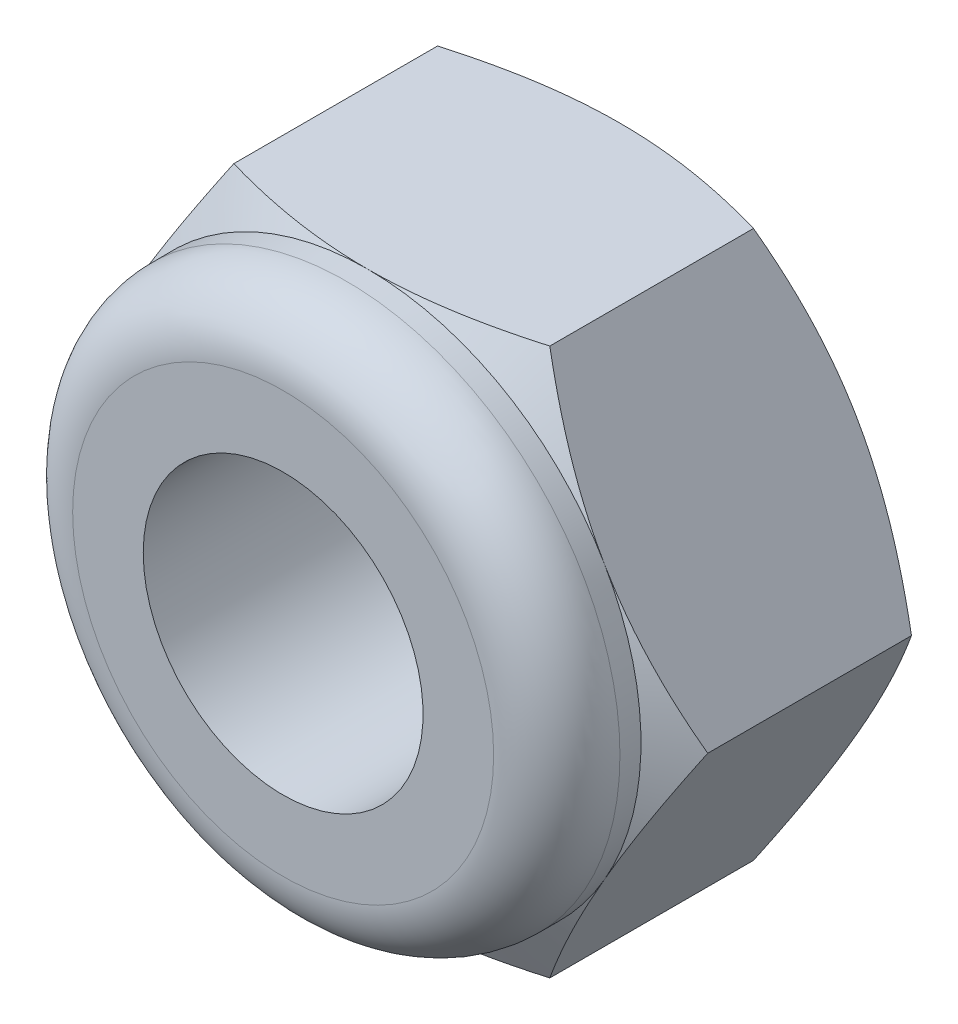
ISO-10303-21;
HEADER;
FILE_DESCRIPTION(('STEP AP214'),'2;1');
FILE_NAME('part.step','',(''),(''),'','','');
FILE_SCHEMA(('AUTOMOTIVE_DESIGN { 1 0 10303 214 1 1 1 1 }'));
ENDSEC;
DATA;
#1=APPLICATION_CONTEXT('core data for automotive mechanical design processes');
#2=APPLICATION_PROTOCOL_DEFINITION('international standard','automotive_design',2000,#1);
#3=PRODUCT_CONTEXT('',#1,'mechanical');
#4=PRODUCT('Part','Part','',(#3));
#5=PRODUCT_RELATED_PRODUCT_CATEGORY('part','',(#4));
#6=PRODUCT_DEFINITION_FORMATION('','',#4);
#7=PRODUCT_DEFINITION_CONTEXT('part definition',#1,'design');
#8=PRODUCT_DEFINITION('design','',#6,#7);
#9=PRODUCT_DEFINITION_SHAPE('','',#8);
#10=(LENGTH_UNIT() NAMED_UNIT(*) SI_UNIT(.MILLI.,.METRE.));
#11=(NAMED_UNIT(*) PLANE_ANGLE_UNIT() SI_UNIT($,.RADIAN.));
#12=(NAMED_UNIT(*) SI_UNIT($,.STERADIAN.) SOLID_ANGLE_UNIT());
#13=UNCERTAINTY_MEASURE_WITH_UNIT(LENGTH_MEASURE(1.E-05),#10,'distance_accuracy_value','');
#14=(GEOMETRIC_REPRESENTATION_CONTEXT(3) GLOBAL_UNCERTAINTY_ASSIGNED_CONTEXT((#13)) GLOBAL_UNIT_ASSIGNED_CONTEXT((#10,
#11,#12)) REPRESENTATION_CONTEXT('',''));
#15=CARTESIAN_POINT('',(0.,0.,0.));
#16=DIRECTION('',(0.,0.,1.));
#17=DIRECTION('',(1.,0.,0.));
#18=AXIS2_PLACEMENT_3D('',#15,#16,#17);
#19=CARTESIAN_POINT('',(0.,0.,-0.584039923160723));
#20=DIRECTION('',(0.,0.,-1.));
#21=DIRECTION('',(-1.,0.,0.));
#22=AXIS2_PLACEMENT_3D('',#19,#20,#21);
#23=CONICAL_SURFACE('',#22,7.51158682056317,1.0471975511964);
#24=CARTESIAN_POINT('',(0.,-6.5,3.6505613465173E-13));
#25=CARTESIAN_POINT('',(-0.159284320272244,-6.5,2.65652581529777E-05));
#26=CARTESIAN_POINT('',(-0.318560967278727,-6.5,-0.00337972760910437));
#27=CARTESIAN_POINT('',(-0.636801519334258,-6.5,-0.0168605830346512));
#28=CARTESIAN_POINT('',(-0.79576548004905,-6.5,-0.0269338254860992));
#29=CARTESIAN_POINT('',(-1.11235387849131,-6.5,-0.0534848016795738));
#30=CARTESIAN_POINT('',(-1.2699810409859,-6.5,-0.0699302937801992));
#31=CARTESIAN_POINT('',(-1.58448437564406,-6.5,-0.108872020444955));
#32=CARTESIAN_POINT('',(-1.74136052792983,-6.5,-0.131368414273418));
#33=CARTESIAN_POINT('',(-2.21021220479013,-6.5,-0.207238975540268));
#34=CARTESIAN_POINT('',(-2.52082569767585,-6.5,-0.269031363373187));
#35=CARTESIAN_POINT('',(-3.13938154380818,-6.5,-0.411540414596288));
#36=CARTESIAN_POINT('',(-3.44730232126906,-6.5,-0.492351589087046));
#37=CARTESIAN_POINT('',(-3.752776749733,-6.5,-0.580556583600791));
#38=B_SPLINE_CURVE_WITH_KNOTS('',3,(#24,#25,#26,#27,#28,#29,#30,#31,#32,#33,#34,#35,#36,#37),
.UNSPECIFIED.,.F.,.F.,(4,2,2,2,2,2,4),(0.,0.477804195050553,0.955513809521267,1.43083727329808,
1.90617324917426,2.85559935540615,3.80984701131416),.UNSPECIFIED.);
#39=CARTESIAN_POINT('',(0.,-6.5,0.));
#40=VERTEX_POINT('',#39);
#41=CARTESIAN_POINT('',(-3.752776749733,-6.5,-0.580556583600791));
#42=VERTEX_POINT('',#41);
#43=EDGE_CURVE('E125',#40,#42,#38,.T.);
#44=ORIENTED_EDGE('',*,*,#43,.F.);
#45=CARTESIAN_POINT('',(0.,0.,2.73652628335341E-13));
#46=DIRECTION('',(0.,0.,-1.));
#47=DIRECTION('',(1.,0.,0.));
#48=AXIS2_PLACEMENT_3D('',#45,#46,#47);
#49=CIRCLE('',#48,6.50000000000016);
#50=CARTESIAN_POINT('',(-5.62916512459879,-3.25000000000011,0.));
#51=VERTEX_POINT('',#50);
#52=EDGE_CURVE('E375',#40,#51,#49,.T.);
#53=ORIENTED_EDGE('',*,*,#52,.T.);
#54=CARTESIAN_POINT('',(-3.752776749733,-6.5,-0.580556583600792));
#55=CARTESIAN_POINT('',(-3.90551397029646,-6.23545137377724,-0.492351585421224));
#56=CARTESIAN_POINT('',(-4.05947436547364,-5.96878414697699,-0.411540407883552));
#57=CARTESIAN_POINT('',(-4.36875230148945,-5.4330990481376,-0.269031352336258));
#58=CARTESIAN_POINT('',(-4.52405905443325,-5.1640998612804,-0.207238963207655));
#59=CARTESIAN_POINT('',(-4.75848490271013,-4.75806238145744,-0.131368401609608));
#60=CARTESIAN_POINT('',(-4.83692298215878,-4.62220364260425,-0.108872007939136));
#61=CARTESIAN_POINT('',(-4.9941746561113,-4.34983575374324,-0.0699302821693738));
#62=CARTESIAN_POINT('',(-5.07298824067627,-4.2133266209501,-0.0534847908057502));
#63=CARTESIAN_POINT('',(-5.23128244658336,-3.93915301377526,-0.0269338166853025));
#64=CARTESIAN_POINT('',(-5.31076443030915,-3.80148617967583,-0.0168605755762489));
#65=CARTESIAN_POINT('',(-5.46988471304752,-3.52588176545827,-0.00337972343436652));
#66=CARTESIAN_POINT('',(-5.54952303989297,-3.38794413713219,2.65674914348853E-05));
#67=CARTESIAN_POINT('',(-5.62916520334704,-3.24999986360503,1.05718922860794E-13));
#68=B_SPLINE_CURVE_WITH_KNOTS('',3,(#54,#55,#56,#57,#58,#59,#60,#61,#62,#63,#64,#65,#66,#67),
.UNSPECIFIED.,.F.,.F.,(4,2,2,2,2,2,4),(0.,0.954247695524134,1.90367384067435,2.3790098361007,
2.85433331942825,3.33204295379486,3.80984716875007),.UNSPECIFIED.);
#69=EDGE_CURVE('E306',#42,#51,#68,.T.);
#70=ORIENTED_EDGE('',*,*,#69,.F.);
#71=EDGE_LOOP('',(#44,#53,#70));
#72=FACE_BOUND('',#71,.T.);
#73=ADVANCED_FACE('F41',(#72),#23,.T.);
#74=CARTESIAN_POINT('',(0.,0.,-0.584039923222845));
#75=DIRECTION('',(0.,0.,-1.));
#76=DIRECTION('',(-1.,0.,0.));
#77=AXIS2_PLACEMENT_3D('',#74,#75,#76);
#78=CONICAL_SURFACE('',#77,7.51158682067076,1.0471975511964);
#79=CARTESIAN_POINT('',(-5.62916520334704,-3.24999986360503,1.0578884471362E-13));
#80=CARTESIAN_POINT('',(-5.70880736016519,-3.11205560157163,2.65630243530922E-05));
#81=CARTESIAN_POINT('',(-5.78844568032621,-2.97411798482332,-0.00337973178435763));
#82=CARTESIAN_POINT('',(-5.94756594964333,-2.69851359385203,-0.0168605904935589));
#83=CARTESIAN_POINT('',(-6.02704792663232,-2.5608467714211,-0.0269338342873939));
#84=CARTESIAN_POINT('',(-6.18534211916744,-2.28667318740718,-0.0534848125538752));
#85=CARTESIAN_POINT('',(-6.26415569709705,-2.15016406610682,-0.0699303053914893));
#86=CARTESIAN_POINT('',(-6.42140735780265,-1.87779620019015,-0.10887203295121));
#87=CARTESIAN_POINT('',(-6.49984543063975,-1.7419374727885,-0.131368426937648));
#88=CARTESIAN_POINT('',(-6.73427125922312,-1.3359000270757,-0.207238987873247));
#89=CARTESIAN_POINT('',(-6.88957799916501,-1.06690086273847,-0.269031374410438));
#90=CARTESIAN_POINT('',(-7.19885590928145,-0.531215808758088,-0.411540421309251));
#91=CARTESIAN_POINT('',(-7.35281629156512,-0.264548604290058,-0.492351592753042));
#92=CARTESIAN_POINT('',(-7.50555349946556,-2.9712334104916E-13,-0.580556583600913));
#93=B_SPLINE_CURVE_WITH_KNOTS('',3,(#79,#80,#81,#82,#83,#84,#85,#86,#87,#88,#89,#90,#91,#92),
.UNSPECIFIED.,.F.,.F.,(4,2,2,2,2,2,4),(0.,0.477804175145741,0.95551376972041,1.43083721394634,
1.90617317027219,2.85559923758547,3.80984685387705),.UNSPECIFIED.);
#94=CARTESIAN_POINT('',(-7.50555349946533,-2.39924732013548E-13,-0.580556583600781));
#95=VERTEX_POINT('',#94);
#96=EDGE_CURVE('E124',#51,#95,#93,.T.);
#97=ORIENTED_EDGE('',*,*,#96,.F.);
#98=CARTESIAN_POINT('',(0.,0.,1.01481323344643E-13));
#99=DIRECTION('',(0.,0.,-1.));
#100=DIRECTION('',(1.,0.,0.));
#101=AXIS2_PLACEMENT_3D('',#98,#99,#100);
#102=CIRCLE('',#101,6.50000000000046);
#103=CARTESIAN_POINT('',(-5.62916512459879,3.25000000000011,0.));
#104=VERTEX_POINT('',#103);
#105=EDGE_CURVE('E380',#51,#104,#102,.T.);
#106=ORIENTED_EDGE('',*,*,#105,.T.);
#107=CARTESIAN_POINT('',(-7.50555349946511,-1.81661842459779E-13,-0.580556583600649));
#108=CARTESIAN_POINT('',(-7.35281627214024,0.264548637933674,-0.492351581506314));
#109=CARTESIAN_POINT('',(-7.19885587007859,0.531215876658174,-0.411540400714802));
#110=CARTESIAN_POINT('',(-6.88957792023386,1.06690099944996,-0.269031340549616));
#111=CARTESIAN_POINT('',(-6.7342711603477,1.33590019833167,-0.207238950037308));
#112=CARTESIAN_POINT('',(-6.49984530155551,1.7419376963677,-0.131368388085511));
#113=CARTESIAN_POINT('',(-6.42140721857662,1.87779644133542,-0.108871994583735));
#114=CARTESIAN_POINT('',(-6.26415553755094,2.15016434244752,-0.069930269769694));
#115=CARTESIAN_POINT('',(-6.18534194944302,2.28667348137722,-0.0534847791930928));
#116=CARTESIAN_POINT('',(-6.02704773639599,2.56084710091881,-0.0269338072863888));
#117=CARTESIAN_POINT('',(-5.94756574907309,2.69851394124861,-0.0168605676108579));
#118=CARTESIAN_POINT('',(-5.78844545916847,2.97411836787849,-0.00337971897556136));
#119=CARTESIAN_POINT('',(-5.70880712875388,3.1120560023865,2.65698769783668E-05));
#120=CARTESIAN_POINT('',(-5.62916496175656,3.25000028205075,4.69329275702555E-13));
#121=B_SPLINE_CURVE_WITH_KNOTS('',3,(#107,#108,#109,#110,#111,#112,#113,#114,#115,#116,#117,
#118,#119,#120),.UNSPECIFIED.,.F.,.F.,(4,2,2,2,2,2,4),(0.,0.95424773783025,1.9036739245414,
2.3790099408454,2.85433344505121,3.33204310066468,3.80984733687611),.UNSPECIFIED.);
#122=EDGE_CURVE('E291',#95,#104,#121,.T.);
#123=ORIENTED_EDGE('',*,*,#122,.F.);
#124=EDGE_LOOP('',(#97,#106,#123));
#125=FACE_BOUND('',#124,.T.);
#126=ADVANCED_FACE('F316',(#125),#78,.T.);
#127=CARTESIAN_POINT('',(0.,0.,-0.5840399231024));
#128=DIRECTION('',(0.,0.,-1.));
#129=DIRECTION('',(0.,1.,0.));
#130=AXIS2_PLACEMENT_3D('',#127,#128,#129);
#131=CONICAL_SURFACE('',#130,7.51158682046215,1.0471975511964);
#132=CARTESIAN_POINT('',(-5.62916496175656,3.25000028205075,4.69415984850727E-13));
#133=CARTESIAN_POINT('',(-5.54952280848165,3.38794453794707,2.65606395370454E-05));
#134=CARTESIAN_POINT('',(-5.46988449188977,3.52588214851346,-0.00337973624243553));
#135=CARTESIAN_POINT('',(-5.31076422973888,3.80148652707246,-0.0168605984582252));
#136=CARTESIAN_POINT('',(-5.231282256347,3.93915334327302,-0.0269338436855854));
#137=CARTESIAN_POINT('',(-5.07298807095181,4.21332691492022,-0.0534848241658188));
#138=CARTESIAN_POINT('',(-4.99417449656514,4.34983603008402,-0.0699303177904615));
#139=CARTESIAN_POINT('',(-4.8369228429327,4.62220388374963,-0.108872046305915));
#140=CARTESIAN_POINT('',(-4.75848477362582,4.75806260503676,-0.131368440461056));
#141=CARTESIAN_POINT('',(-4.52405895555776,5.16410003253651,-0.207239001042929));
#142=CARTESIAN_POINT('',(-4.36875222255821,5.43309918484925,-0.269031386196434));
#143=CARTESIAN_POINT('',(-4.05947432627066,5.96878421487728,-0.411540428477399));
#144=CARTESIAN_POINT('',(-3.90551395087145,6.23545140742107,-0.492351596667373));
#145=CARTESIAN_POINT('',(-3.75277674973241,6.49999999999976,-0.580556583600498));
#146=B_SPLINE_CURVE_WITH_KNOTS('',3,(#132,#133,#134,#135,#136,#137,#138,#139,#140,#141,#142,
#143,#144,#145),.UNSPECIFIED.,.F.,.F.,(4,2,2,2,2,2,4),(0.,0.477804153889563,0.955513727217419,
1.43083715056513,1.90617308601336,2.85559911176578,3.80984668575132),.UNSPECIFIED.);
#147=CARTESIAN_POINT('',(-3.7527767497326,6.49999999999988,-0.580556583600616));
#148=VERTEX_POINT('',#147);
#149=EDGE_CURVE('E299',#104,#148,#146,.T.);
#150=ORIENTED_EDGE('',*,*,#149,.F.);
#151=CARTESIAN_POINT('',(0.,0.,1.31838984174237E-13));
#152=DIRECTION('',(0.,0.,-1.));
#153=DIRECTION('',(1.,0.,0.));
#154=AXIS2_PLACEMENT_3D('',#151,#152,#153);
#155=CIRCLE('',#154,6.50000000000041);
#156=CARTESIAN_POINT('',(0.,6.5,0.));
#157=VERTEX_POINT('',#156);
#158=EDGE_CURVE('E382',#104,#157,#155,.T.);
#159=ORIENTED_EDGE('',*,*,#158,.T.);
#160=CARTESIAN_POINT('',(-3.7527767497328,6.5,-0.580556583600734));
#161=CARTESIAN_POINT('',(-3.44730232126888,6.5,-0.492351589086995));
#162=CARTESIAN_POINT('',(-3.13938154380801,6.5,-0.411540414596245));
#163=CARTESIAN_POINT('',(-2.52082569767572,6.5,-0.269031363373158));
#164=CARTESIAN_POINT('',(-2.21021220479,6.5,-0.207238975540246));
#165=CARTESIAN_POINT('',(-1.74136052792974,6.5,-0.131368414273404));
#166=CARTESIAN_POINT('',(-1.58448437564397,6.5,-0.108872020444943));
#167=CARTESIAN_POINT('',(-1.26998104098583,6.5,-0.069930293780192));
#168=CARTESIAN_POINT('',(-1.11235387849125,6.5,-0.0534848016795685));
#169=CARTESIAN_POINT('',(-0.795765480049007,6.5,-0.0269338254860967));
#170=CARTESIAN_POINT('',(-0.636801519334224,6.5,-0.0168605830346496));
#171=CARTESIAN_POINT('',(-0.318560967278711,6.5,-0.00337972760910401));
#172=CARTESIAN_POINT('',(-0.159284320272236,6.5,2.65652581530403E-05));
#173=CARTESIAN_POINT('',(0.,6.5,3.64962709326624E-13));
#174=B_SPLINE_CURVE_WITH_KNOTS('',3,(#160,#161,#162,#163,#164,#165,#166,#167,#168,#169,#170,
#171,#172,#173),.UNSPECIFIED.,.F.,.F.,(4,2,2,2,2,2,4),(0.,0.954247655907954,1.90367376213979,
2.37900973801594,2.85433320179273,3.33204281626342,3.80984701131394),.UNSPECIFIED.);
#175=EDGE_CURVE('E321',#148,#157,#174,.T.);
#176=ORIENTED_EDGE('',*,*,#175,.F.);
#177=EDGE_LOOP('',(#150,#159,#176));
#178=FACE_BOUND('',#177,.T.);
#179=ADVANCED_FACE('F313',(#178),#131,.T.);
#180=CARTESIAN_POINT('',(0.,0.,-0.5840399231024));
#181=DIRECTION('',(0.,0.,-1.));
#182=DIRECTION('',(0.,1.,0.));
#183=AXIS2_PLACEMENT_3D('',#180,#181,#182);
#184=CONICAL_SURFACE('',#183,7.51158682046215,1.0471975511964);
#185=CARTESIAN_POINT('',(0.,6.5,3.65048800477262E-13));
#186=CARTESIAN_POINT('',(0.159284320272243,6.5,2.6565258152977E-05));
#187=CARTESIAN_POINT('',(0.318560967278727,6.5,-0.0033797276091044));
#188=CARTESIAN_POINT('',(0.636801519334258,6.5,-0.0168605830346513));
#189=CARTESIAN_POINT('',(0.79576548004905,6.5,-0.0269338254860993));
#190=CARTESIAN_POINT('',(1.11235387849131,6.5,-0.0534848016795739));
#191=CARTESIAN_POINT('',(1.2699810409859,6.5,-0.0699302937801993));
#192=CARTESIAN_POINT('',(1.58448437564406,6.5,-0.108872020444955));
#193=CARTESIAN_POINT('',(1.74136052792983,6.5,-0.131368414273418));
#194=CARTESIAN_POINT('',(2.21021220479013,6.5,-0.207238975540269));
#195=CARTESIAN_POINT('',(2.52082569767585,6.5,-0.269031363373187));
#196=CARTESIAN_POINT('',(3.13938154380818,6.5,-0.411540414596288));
#197=CARTESIAN_POINT('',(3.44730232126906,6.5,-0.492351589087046));
#198=CARTESIAN_POINT('',(3.752776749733,6.5,-0.580556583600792));
#199=B_SPLINE_CURVE_WITH_KNOTS('',3,(#185,#186,#187,#188,#189,#190,#191,#192,#193,#194,#195,
#196,#197,#198),.UNSPECIFIED.,.F.,.F.,(4,2,2,2,2,2,4),(0.,0.477804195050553,0.955513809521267,
1.43083727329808,1.90617324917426,2.85559935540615,3.80984701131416),.UNSPECIFIED.);
#200=CARTESIAN_POINT('',(3.752776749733,6.5,-0.580556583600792));
#201=VERTEX_POINT('',#200);
#202=EDGE_CURVE('E334',#157,#201,#199,.T.);
#203=ORIENTED_EDGE('',*,*,#202,.F.);
#204=CARTESIAN_POINT('',(0.,0.,2.73652628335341E-13));
#205=DIRECTION('',(0.,0.,-1.));
#206=DIRECTION('',(1.,0.,0.));
#207=AXIS2_PLACEMENT_3D('',#204,#205,#206);
#208=CIRCLE('',#207,6.50000000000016);
#209=CARTESIAN_POINT('',(5.62916512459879,3.25000000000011,0.));
#210=VERTEX_POINT('',#209);
#211=EDGE_CURVE('E359',#157,#210,#208,.T.);
#212=ORIENTED_EDGE('',*,*,#211,.T.);
#213=CARTESIAN_POINT('',(3.752776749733,6.5,-0.580556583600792));
#214=CARTESIAN_POINT('',(3.90551396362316,6.23545138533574,-0.492351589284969));
#215=CARTESIAN_POINT('',(4.05947435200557,5.96878417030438,-0.411540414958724));
#216=CARTESIAN_POINT('',(4.36875227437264,5.4330990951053,-0.269031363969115));
#217=CARTESIAN_POINT('',(4.52405902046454,5.16409992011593,-0.207238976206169));
#218=CARTESIAN_POINT('',(4.75848485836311,4.75806245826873,-0.131368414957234));
#219=CARTESIAN_POINT('',(4.83692293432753,4.62220372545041,-0.108872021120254));
#220=CARTESIAN_POINT('',(4.99417460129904,4.34983584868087,-0.0699302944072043));
#221=CARTESIAN_POINT('',(5.07298818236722,4.21332672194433,-0.0534848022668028));
#222=CARTESIAN_POINT('',(5.23128238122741,3.93915312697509,-0.0269338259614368));
#223=CARTESIAN_POINT('',(5.31076436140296,3.80148629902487,-0.0168605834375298));
#224=CARTESIAN_POINT('',(5.46988463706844,3.52588189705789,-0.00337972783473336));
#225=CARTESIAN_POINT('',(5.54952296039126,3.38794427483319,2.65651373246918E-05));
#226=CARTESIAN_POINT('',(5.62916512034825,3.25000000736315,1.06755980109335E-13));
#227=B_SPLINE_CURVE_WITH_KNOTS('',3,(#213,#214,#215,#216,#217,#218,#219,#220,#221,#222,#223,
#224,#225,#226),.UNSPECIFIED.,.F.,.F.,(4,2,2,2,2,2,4),(0.,0.954247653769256,1.90367375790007,
2.37900973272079,2.85433319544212,3.33204280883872,3.80984700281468),.UNSPECIFIED.);
#228=EDGE_CURVE('E143',#201,#210,#227,.T.);
#229=ORIENTED_EDGE('',*,*,#228,.F.);
#230=EDGE_LOOP('',(#203,#212,#229));
#231=FACE_BOUND('',#230,.T.);
#232=ADVANCED_FACE('F176',(#231),#184,.T.);
#233=CARTESIAN_POINT('',(0.,0.,-0.5840399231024));
#234=DIRECTION('',(0.,0.,-1.));
#235=DIRECTION('',(0.,1.,0.));
#236=AXIS2_PLACEMENT_3D('',#233,#234,#235);
#237=CONICAL_SURFACE('',#236,7.51158682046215,1.0471975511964);
#238=CARTESIAN_POINT('',(5.6291651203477,-3.25000000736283,4.74270947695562E-13));
#239=CARTESIAN_POINT('',(5.5495229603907,-3.38794427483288,2.65651376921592E-05));
#240=CARTESIAN_POINT('',(5.46988463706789,-3.52588189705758,-0.00337972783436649));
#241=CARTESIAN_POINT('',(5.3107643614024,-3.80148629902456,-0.016860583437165));
#242=CARTESIAN_POINT('',(5.23128238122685,-3.93915312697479,-0.0269338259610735));
#243=CARTESIAN_POINT('',(5.07298818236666,-4.21332672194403,-0.0534848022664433));
#244=CARTESIAN_POINT('',(4.99417460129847,-4.34983584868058,-0.0699302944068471));
#245=CARTESIAN_POINT('',(4.83692293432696,-4.62220372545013,-0.108872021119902));
#246=CARTESIAN_POINT('',(4.75848485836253,-4.75806245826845,-0.131368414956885));
#247=CARTESIAN_POINT('',(4.52405902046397,-5.16409992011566,-0.20723897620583));
#248=CARTESIAN_POINT('',(4.36875227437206,-5.43309909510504,-0.269031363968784));
#249=CARTESIAN_POINT('',(4.05947435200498,-5.96878417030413,-0.411540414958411));
#250=CARTESIAN_POINT('',(3.90551396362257,-6.23545138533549,-0.492351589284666));
#251=CARTESIAN_POINT('',(3.75277674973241,-6.49999999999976,-0.580556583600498));
#252=B_SPLINE_CURVE_WITH_KNOTS('',3,(#238,#239,#240,#241,#242,#243,#244,#245,#246,#247,#248,
#249,#250,#251),.UNSPECIFIED.,.F.,.F.,(4,2,2,2,2,2,4),(0.,0.477804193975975,0.955513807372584,
1.43083727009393,1.90617324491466,2.8555993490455,3.80984700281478),.UNSPECIFIED.);
#253=CARTESIAN_POINT('',(5.62916512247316,-3.25000000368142,3.40134680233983E-13));
#254=VERTEX_POINT('',#253);
#255=CARTESIAN_POINT('',(3.75277674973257,-6.49999999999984,-0.580556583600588));
#256=VERTEX_POINT('',#255);
#257=EDGE_CURVE('E117',#254,#256,#252,.T.);
#258=ORIENTED_EDGE('',*,*,#257,.F.);
#259=CARTESIAN_POINT('',(0.,0.,2.05998412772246E-13));
#260=DIRECTION('',(0.,0.,-1.));
#261=DIRECTION('',(1.,0.,0.));
#262=AXIS2_PLACEMENT_3D('',#259,#260,#261);
#263=CIRCLE('',#262,6.50000000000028);
#264=EDGE_CURVE('E120',#254,#40,#263,.T.);
#265=ORIENTED_EDGE('',*,*,#264,.T.);
#266=CARTESIAN_POINT('',(3.7527767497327,-6.5,-0.580556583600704));
#267=CARTESIAN_POINT('',(3.44730232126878,-6.5,-0.49235158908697));
#268=CARTESIAN_POINT('',(3.13938154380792,-6.5,-0.411540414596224));
#269=CARTESIAN_POINT('',(2.52082569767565,-6.5,-0.269031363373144));
#270=CARTESIAN_POINT('',(2.21021220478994,-6.5,-0.207238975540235));
#271=CARTESIAN_POINT('',(1.74136052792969,-6.5,-0.131368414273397));
#272=CARTESIAN_POINT('',(1.58448437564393,-6.5,-0.108872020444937));
#273=CARTESIAN_POINT('',(1.26998104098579,-6.5,-0.069930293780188));
#274=CARTESIAN_POINT('',(1.11235387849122,-6.5,-0.0534848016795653));
#275=CARTESIAN_POINT('',(0.795765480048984,-6.5,-0.0269338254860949));
#276=CARTESIAN_POINT('',(0.636801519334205,-6.5,-0.0168605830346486));
#277=CARTESIAN_POINT('',(0.318560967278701,-6.5,-0.00337972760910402));
#278=CARTESIAN_POINT('',(0.159284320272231,-6.5,2.65652581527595E-05));
#279=CARTESIAN_POINT('',(0.,-6.5,3.64925290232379E-13));
#280=B_SPLINE_CURVE_WITH_KNOTS('',3,(#266,#267,#268,#269,#270,#271,#272,#273,#274,#275,#276,
#277,#278,#279),.UNSPECIFIED.,.F.,.F.,(4,2,2,2,2,2,4),(0.,0.954247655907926,1.90367376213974,
2.37900973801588,2.85433320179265,3.33204281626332,3.80984701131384),.UNSPECIFIED.);
#281=EDGE_CURVE('E113',#256,#40,#280,.T.);
#282=ORIENTED_EDGE('',*,*,#281,.F.);
#283=EDGE_LOOP('',(#258,#265,#282));
#284=FACE_BOUND('',#283,.T.);
#285=ADVANCED_FACE('F115',(#284),#237,.T.);
#286=CARTESIAN_POINT('',(0.,0.,-0.584039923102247));
#287=DIRECTION('',(0.,0.,-1.));
#288=DIRECTION('',(0.,1.,0.));
#289=AXIS2_PLACEMENT_3D('',#286,#287,#288);
#290=CONICAL_SURFACE('',#289,7.51158682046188,1.0471975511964);
#291=CARTESIAN_POINT('',(5.62916512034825,3.25000000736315,1.07249429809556E-13));
#292=CARTESIAN_POINT('',(5.70880728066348,3.11205573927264,2.65653784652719E-05));
#293=CARTESIAN_POINT('',(5.78844560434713,2.97411811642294,-0.00337972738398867));
#294=CARTESIAN_POINT('',(5.94756588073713,2.69851371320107,-0.0168605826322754));
#295=CARTESIAN_POINT('',(6.02704786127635,2.56084688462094,-0.0269338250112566));
#296=CARTESIAN_POINT('',(6.18534206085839,2.28667328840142,-0.0534848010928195));
#297=CARTESIAN_POINT('',(6.26415564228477,2.15016416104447,-0.069930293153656));
#298=CARTESIAN_POINT('',(6.42140730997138,1.87779628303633,-0.108872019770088));
#299=CARTESIAN_POINT('',(6.49984538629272,1.74193754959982,-0.131368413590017));
#300=CARTESIAN_POINT('',(6.73427122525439,1.33590008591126,-0.207238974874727));
#301=CARTESIAN_POINT('',(6.88957797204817,1.06690090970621,-0.269031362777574));
#302=CARTESIAN_POINT('',(7.19885589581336,0.531215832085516,-0.411540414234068));
#303=CARTESIAN_POINT('',(7.3528162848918,0.264548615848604,-0.492351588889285));
#304=CARTESIAN_POINT('',(7.50555349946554,3.41994650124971E-13,-0.580556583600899));
#305=B_SPLINE_CURVE_WITH_KNOTS('',3,(#291,#292,#293,#294,#295,#296,#297,#298,#299,#300,#301,
#302,#303,#304),.UNSPECIFIED.,.F.,.F.,(4,2,2,2,2,2,4),(0.,0.477804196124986,0.95551381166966,
1.4308372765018,1.90617325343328,2.85559936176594,3.80984701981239),.UNSPECIFIED.);
#306=CARTESIAN_POINT('',(7.50555349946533,2.8374856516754E-13,-0.580556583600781));
#307=VERTEX_POINT('',#306);
#308=EDGE_CURVE('E328',#210,#307,#305,.T.);
#309=ORIENTED_EDGE('',*,*,#308,.F.);
#310=CARTESIAN_POINT('',(0.,0.,2.73652628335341E-13));
#311=DIRECTION('',(0.,0.,-1.));
#312=DIRECTION('',(1.,0.,0.));
#313=AXIS2_PLACEMENT_3D('',#310,#311,#312);
#314=CIRCLE('',#313,6.50000000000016);
#315=EDGE_CURVE('E358',#210,#254,#314,.T.);
#316=ORIENTED_EDGE('',*,*,#315,.T.);
#317=CARTESIAN_POINT('',(7.50555349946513,2.25393252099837E-13,-0.580556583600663));
#318=CARTESIAN_POINT('',(7.35281628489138,-0.264548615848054,-0.492351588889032));
#319=CARTESIAN_POINT('',(7.19885589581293,-0.531215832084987,-0.411540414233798));
#320=CARTESIAN_POINT('',(6.88957797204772,-1.06690090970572,-0.269031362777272));
#321=CARTESIAN_POINT('',(6.73427122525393,-1.33590008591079,-0.20723897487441));
#322=CARTESIAN_POINT('',(6.49984538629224,-1.74193754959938,-0.131368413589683));
#323=CARTESIAN_POINT('',(6.4214073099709,-1.8777962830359,-0.108872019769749));
#324=CARTESIAN_POINT('',(6.26415564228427,-2.15016416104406,-0.0699302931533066));
#325=CARTESIAN_POINT('',(6.18534206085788,-2.28667328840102,-0.0534848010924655));
#326=CARTESIAN_POINT('',(6.02704786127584,-2.56084688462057,-0.0269338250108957));
#327=CARTESIAN_POINT('',(5.94756588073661,-2.6985137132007,-0.0168605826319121));
#328=CARTESIAN_POINT('',(5.78844560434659,-2.9741181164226,-0.00337972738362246));
#329=CARTESIAN_POINT('',(5.70880728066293,-3.11205573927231,2.65653788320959E-05));
#330=CARTESIAN_POINT('',(5.6291651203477,-3.25000000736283,4.74095637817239E-13));
#331=B_SPLINE_CURVE_WITH_KNOTS('',3,(#317,#318,#319,#320,#321,#322,#323,#324,#325,#326,#327,
#328,#329,#330),.UNSPECIFIED.,.F.,.F.,(4,2,2,2,2,2,4),(0.,0.954247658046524,1.90367376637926,
2.37900974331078,2.85433320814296,3.33204282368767,3.8098470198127),.UNSPECIFIED.);
#332=EDGE_CURVE('E141',#307,#254,#331,.T.);
#333=ORIENTED_EDGE('',*,*,#332,.F.);
#334=EDGE_LOOP('',(#309,#316,#333));
#335=FACE_BOUND('',#334,.T.);
#336=ADVANCED_FACE('F175',(#335),#290,.T.);
#337=CARTESIAN_POINT('',(3.752776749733,-6.5,0.));
#338=DIRECTION('',(0.,-1.,0.));
#339=DIRECTION('',(0.,0.,-1.));
#340=AXIS2_PLACEMENT_3D('',#337,#338,#339);
#341=PLANE('',#340);
#342=DIRECTION('',(0.,0.,1.));
#343=VECTOR('',#342,1.);
#344=CARTESIAN_POINT('',(3.75277674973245,-6.49999999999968,0.));
#345=LINE('',#344,#343);
#346=CARTESIAN_POINT('',(3.75277676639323,-6.49999999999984,-5.41944341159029));
#347=VERTEX_POINT('',#346);
#348=EDGE_CURVE('E128',#256,#347,#345,.F.);
#349=ORIENTED_EDGE('',*,*,#348,.F.);
#350=ORIENTED_EDGE('',*,*,#281,.T.);
#351=ORIENTED_EDGE('',*,*,#43,.T.);
#352=DIRECTION('',(0.,0.,1.));
#353=VECTOR('',#352,1.);
#354=CARTESIAN_POINT('',(-3.752776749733,-6.5,0.));
#355=LINE('',#354,#353);
#356=CARTESIAN_POINT('',(-3.75277674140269,-6.50000001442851,-5.41944341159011));
#357=VERTEX_POINT('',#356);
#358=EDGE_CURVE('E421',#357,#42,#355,.T.);
#359=ORIENTED_EDGE('',*,*,#358,.F.);
#360=CARTESIAN_POINT('',(0.,-6.5,-6.00000000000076));
#361=CARTESIAN_POINT('',(-0.159284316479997,-6.5,-6.00002656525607));
#362=CARTESIAN_POINT('',(-0.318560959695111,-6.5,-5.99662027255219));
#363=CARTESIAN_POINT('',(-0.636801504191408,-6.5,-5.98313941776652));
#364=CARTESIAN_POINT('',(-0.795765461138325,-6.5,-5.97306617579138));
#365=CARTESIAN_POINT('',(-1.11235385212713,-6.5,-5.94651520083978));
#366=CARTESIAN_POINT('',(-1.26998101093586,-6.5,-5.93006970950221));
#367=CARTESIAN_POINT('',(-1.58448433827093,-6.5,-5.89112798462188));
#368=CARTESIAN_POINT('',(-1.74136048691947,-6.5,-5.86863159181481));
#369=CARTESIAN_POINT('',(-2.21021215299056,-6.5,-5.79276103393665));
#370=CARTESIAN_POINT('',(-2.52082563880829,-6.5,-5.73096864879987));
#371=CARTESIAN_POINT('',(-3.13938147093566,-6.5,-5.58845960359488));
#372=CARTESIAN_POINT('',(-3.44730224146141,-6.5,-5.50764843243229));
#373=CARTESIAN_POINT('',(-3.7527766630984,-6.5,-5.41944344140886));
#374=B_SPLINE_CURVE_WITH_KNOTS('',3,(#360,#361,#362,#363,#364,#365,#366,#367,#368,#369,#370,
#371,#372,#373),.UNSPECIFIED.,.F.,.F.,(4,2,2,2,2,2,4),(0.,0.47780418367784,0.955513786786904,
1.43083723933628,1.90617320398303,2.85559928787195,3.80984692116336),.UNSPECIFIED.);
#375=CARTESIAN_POINT('',(0.,-6.50000000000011,-6.0000000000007));
#376=VERTEX_POINT('',#375);
#377=EDGE_CURVE('E209',#376,#357,#374,.T.);
#378=ORIENTED_EDGE('',*,*,#377,.F.);
#379=CARTESIAN_POINT('',(3.75277678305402,-6.5,-5.41944340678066));
#380=CARTESIAN_POINT('',(3.44730235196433,-6.5,-5.50764840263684));
#381=CARTESIAN_POINT('',(3.13938157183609,-6.5,-5.58845957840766));
#382=CARTESIAN_POINT('',(2.52082572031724,-6.5,-5.73096863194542));
#383=CARTESIAN_POINT('',(2.21021222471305,-6.5,-5.79276102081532));
#384=CARTESIAN_POINT('',(1.74136054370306,-6.5,-5.86863158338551));
#385=CARTESIAN_POINT('',(1.58448439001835,-6.5,-5.89112797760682));
#386=CARTESIAN_POINT('',(1.26998105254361,-6.5,-5.93006970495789));
#387=CARTESIAN_POINT('',(1.11235388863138,-6.5,-5.946515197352));
#388=CARTESIAN_POINT('',(0.79576548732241,-6.5,-5.97306617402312));
#389=CARTESIAN_POINT('',(0.636801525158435,-6.5,-5.98313941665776));
#390=CARTESIAN_POINT('',(0.318560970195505,-6.5,-5.99662027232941));
#391=CARTESIAN_POINT('',(0.159284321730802,-6.5,-6.00002656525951));
#392=CARTESIAN_POINT('',(0.,-6.5,-6.00000000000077));
#393=B_SPLINE_CURVE_WITH_KNOTS('',3,(#379,#380,#381,#382,#383,#384,#385,#386,#387,#388,#389,
#390,#391,#392),.UNSPECIFIED.,.F.,.F.,(4,2,2,2,2,2,4),(0.,0.954247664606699,1.90367377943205,
2.37900975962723,2.8543332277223,3.33204284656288,3.80984704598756),.UNSPECIFIED.);
#394=EDGE_CURVE('E131',#347,#376,#393,.T.);
#395=ORIENTED_EDGE('',*,*,#394,.F.);
#396=EDGE_LOOP('',(#349,#350,#351,#359,#378,#395));
#397=FACE_BOUND('',#396,.T.);
#398=ADVANCED_FACE('F129',(#397),#341,.T.);
#399=CARTESIAN_POINT('',(-3.752776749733,-6.5,0.));
#400=DIRECTION('',(-0.866025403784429,-0.500000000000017,0.));
#401=DIRECTION('',(0.500000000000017,-0.866025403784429,0.));
#402=AXIS2_PLACEMENT_3D('',#399,#400,#401);
#403=PLANE('',#402);
#404=ORIENTED_EDGE('',*,*,#358,.T.);
#405=ORIENTED_EDGE('',*,*,#69,.T.);
#406=ORIENTED_EDGE('',*,*,#96,.T.);
#407=DIRECTION('',(0.,0.,1.));
#408=VECTOR('',#407,1.);
#409=CARTESIAN_POINT('',(-7.505553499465,0.,0.));
#410=LINE('',#409,#408);
#411=CARTESIAN_POINT('',(-7.50555350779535,-1.44285809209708E-08,-5.41944341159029));
#412=VERTEX_POINT('',#411);
#413=EDGE_CURVE('E305',#412,#95,#410,.T.);
#414=ORIENTED_EDGE('',*,*,#413,.F.);
#415=CARTESIAN_POINT('',(-5.62916512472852,-3.2499999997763,-6.00000000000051));
#416=CARTESIAN_POINT('',(-5.70880728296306,-3.11205573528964,-6.00002656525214));
#417=CARTESIAN_POINT('',(-5.78844560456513,-2.97411811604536,-5.99662027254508));
#418=CARTESIAN_POINT('',(-5.94756587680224,-2.6985137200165,-5.98313941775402));
#419=CARTESIAN_POINT('',(-6.02704785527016,-2.56084689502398,-5.97306617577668));
#420=CARTESIAN_POINT('',(-6.18534205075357,-2.28667330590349,-5.94651520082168));
#421=CARTESIAN_POINT('',(-6.26415563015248,-2.15016418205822,-5.9300697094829));
#422=CARTESIAN_POINT('',(-6.42140729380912,-1.87779631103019,-5.89112798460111));
#423=CARTESIAN_POINT('',(-6.49984536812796,-1.74193758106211,-5.86863159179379));
#424=CARTESIAN_POINT('',(-6.73427120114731,-1.33590012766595,-5.79276103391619));
#425=CARTESIAN_POINT('',(-6.88957794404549,-1.06690095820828,-5.73096864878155));
#426=CARTESIAN_POINT('',(-7.19885586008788,-0.531215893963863,-5.5884596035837));
#427=CARTESIAN_POINT('',(-7.35281624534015,-0.264548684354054,-5.50764843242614));
#428=CARTESIAN_POINT('',(-7.50555345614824,-7.50281066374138E-08,-5.41944344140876));
#429=B_SPLINE_CURVE_WITH_KNOTS('',3,(#415,#416,#417,#418,#419,#420,#421,#422,#423,#424,#425,
#426,#427,#428),.UNSPECIFIED.,.F.,.F.,(4,2,2,2,2,2,4),(0.,0.477804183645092,0.955513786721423,
1.43083723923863,1.90617320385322,2.8555992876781,3.80984692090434),.UNSPECIFIED.);
#430=CARTESIAN_POINT('',(-5.62916512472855,-3.24999999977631,-6.00000000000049));
#431=VERTEX_POINT('',#430);
#432=EDGE_CURVE('E251',#431,#412,#429,.T.);
#433=ORIENTED_EDGE('',*,*,#432,.F.);
#434=CARTESIAN_POINT('',(-3.75277673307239,-6.50000002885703,-5.4194434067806));
#435=CARTESIAN_POINT('',(-3.90551394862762,-6.23545141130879,-5.50764840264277));
#436=CARTESIAN_POINT('',(-4.05947433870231,-5.96878419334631,-5.58845957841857));
#437=CARTESIAN_POINT('',(-4.36875226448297,-5.43309911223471,-5.73096863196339));
#438=CARTESIAN_POINT('',(-4.52405901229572,-5.16409993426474,-5.79276102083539));
#439=CARTESIAN_POINT('',(-4.75848485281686,-4.75806246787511,-5.8686315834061));
#440=CARTESIAN_POINT('',(-4.83692292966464,-4.62220373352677,-5.89112797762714));
#441=CARTESIAN_POINT('',(-4.99417459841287,-4.34983585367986,-5.93006970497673));
#442=CARTESIAN_POINT('',(-5.07298818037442,-4.21332672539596,-5.94651519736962));
#443=CARTESIAN_POINT('',(-5.23128238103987,-3.93915312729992,-5.97306617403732));
#444=CARTESIAN_POINT('',(-5.31076436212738,-3.80148629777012,-5.98313941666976));
#445=CARTESIAN_POINT('',(-5.46988463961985,-3.52588189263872,-5.99662027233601));
#446=CARTESIAN_POINT('',(-5.54952296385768,-3.38794426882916,-6.00002656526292));
#447=CARTESIAN_POINT('',(-5.62916512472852,-3.2499999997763,-6.00000000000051));
#448=B_SPLINE_CURVE_WITH_KNOTS('',3,(#434,#435,#436,#437,#438,#439,#440,#441,#442,#443,#444,
#445,#446,#447),.UNSPECIFIED.,.F.,.F.,(4,2,2,2,2,2,4),(0.,0.954247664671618,1.90367377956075,
2.37900975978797,2.85433322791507,3.33204284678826,3.80984704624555),.UNSPECIFIED.);
#449=EDGE_CURVE('E243',#357,#431,#448,.T.);
#450=ORIENTED_EDGE('',*,*,#449,.F.);
#451=EDGE_LOOP('',(#404,#405,#406,#414,#433,#450));
#452=FACE_BOUND('',#451,.T.);
#453=ADVANCED_FACE('F202',(#452),#403,.T.);
#454=CARTESIAN_POINT('',(-7.505553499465,0.,0.));
#455=DIRECTION('',(-0.866025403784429,0.500000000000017,0.));
#456=DIRECTION('',(-0.500000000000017,-0.866025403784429,0.));
#457=AXIS2_PLACEMENT_3D('',#454,#455,#456);
#458=PLANE('',#457);
#459=ORIENTED_EDGE('',*,*,#413,.T.);
#460=ORIENTED_EDGE('',*,*,#122,.T.);
#461=ORIENTED_EDGE('',*,*,#149,.T.);
#462=DIRECTION('',(0.,0.,1.));
#463=VECTOR('',#462,1.);
#464=CARTESIAN_POINT('',(-3.752776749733,6.5,0.));
#465=LINE('',#464,#463);
#466=CARTESIAN_POINT('',(-3.75277676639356,6.5,-5.41944341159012));
#467=VERTEX_POINT('',#466);
#468=EDGE_CURVE('E329',#467,#148,#465,.T.);
#469=ORIENTED_EDGE('',*,*,#468,.F.);
#470=CARTESIAN_POINT('',(-5.62916512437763,3.25000000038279,-6.00000000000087));
#471=CARTESIAN_POINT('',(-5.54952296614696,3.38794426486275,-6.00002656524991));
#472=CARTESIAN_POINT('',(-5.46988464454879,3.52588188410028,-5.99662027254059));
#473=CARTESIAN_POINT('',(-5.3107643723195,3.80148628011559,-5.98313941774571));
#474=CARTESIAN_POINT('',(-5.2312823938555,3.93915310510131,-5.9730661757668));
#475=CARTESIAN_POINT('',(-5.07298819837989,4.2133266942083,-5.94651520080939));
#476=CARTESIAN_POINT('',(-4.99417461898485,4.34983581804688,-5.93006970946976));
#477=CARTESIAN_POINT('',(-4.83692295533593,4.62220368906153,-5.89112798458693));
#478=CARTESIAN_POINT('',(-4.75848488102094,4.75806241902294,-5.86863159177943));
#479=CARTESIAN_POINT('',(-4.52405904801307,5.16409987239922,-5.79276103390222));
#480=CARTESIAN_POINT('',(-4.36875230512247,5.43309904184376,-5.73096864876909));
#481=CARTESIAN_POINT('',(-4.05947438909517,5.96878410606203,-5.58845960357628));
#482=CARTESIAN_POINT('',(-3.90551400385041,6.23545131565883,-5.50764843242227));
#483=CARTESIAN_POINT('',(-3.75277679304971,6.49999992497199,-5.41944344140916));
#484=B_SPLINE_CURVE_WITH_KNOTS('',3,(#470,#471,#472,#473,#474,#475,#476,#477,#478,#479,#480,
#481,#482,#483),.UNSPECIFIED.,.F.,.F.,(4,2,2,2,2,2,4),(0.,0.477804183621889,0.955513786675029,
1.43083723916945,1.90617320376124,2.85559928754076,3.80984692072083),.UNSPECIFIED.);
#485=CARTESIAN_POINT('',(-5.62916512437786,3.25000000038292,-6.00000000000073));
#486=VERTEX_POINT('',#485);
#487=EDGE_CURVE('E275',#486,#467,#484,.T.);
#488=ORIENTED_EDGE('',*,*,#487,.F.);
#489=CARTESIAN_POINT('',(-7.50555351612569,-2.88571618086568E-08,-5.41944340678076));
#490=CARTESIAN_POINT('',(-7.35281630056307,0.264548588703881,-5.50764840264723));
#491=CARTESIAN_POINT('',(-7.19885591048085,0.531215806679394,-5.5884595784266));
#492=CARTESIAN_POINT('',(-6.88957798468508,1.06690088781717,-5.7309686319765));
#493=CARTESIAN_POINT('',(-6.73427123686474,1.33590006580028,-5.79276102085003));
#494=CARTESIAN_POINT('',(-6.4998453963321,1.74193753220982,-5.86863158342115));
#495=CARTESIAN_POINT('',(-6.42140731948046,1.87779626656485,-5.89112797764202));
#496=CARTESIAN_POINT('',(-6.2641556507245,2.15016414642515,-5.93006970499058));
#497=CARTESIAN_POINT('',(-6.18534206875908,2.28667327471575,-5.94651519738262));
#498=CARTESIAN_POINT('',(-6.02704786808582,2.56084687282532,-5.97306617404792));
#499=CARTESIAN_POINT('',(-5.94756588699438,2.69851370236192,-5.9831394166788));
#500=CARTESIAN_POINT('',(-5.78844560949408,2.97411810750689,-5.99662027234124));
#501=CARTESIAN_POINT('',(-5.70880728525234,3.11205573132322,-6.00002656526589));
#502=CARTESIAN_POINT('',(-5.62916512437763,3.25000000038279,-6.00000000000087));
#503=B_SPLINE_CURVE_WITH_KNOTS('',3,(#489,#490,#491,#492,#493,#494,#495,#496,#497,#498,#499,
#500,#501,#502),.UNSPECIFIED.,.F.,.F.,(4,2,2,2,2,2,4),(0.,0.954247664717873,1.90367377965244,
2.37900975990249,2.85433322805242,3.33204284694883,3.80984704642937),.UNSPECIFIED.);
#504=EDGE_CURVE('E267',#412,#486,#503,.T.);
#505=ORIENTED_EDGE('',*,*,#504,.F.);
#506=EDGE_LOOP('',(#459,#460,#461,#469,#488,#505));
#507=FACE_BOUND('',#506,.T.);
#508=ADVANCED_FACE('F281',(#507),#458,.T.);
#509=CARTESIAN_POINT('',(-3.752776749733,6.5,0.));
#510=DIRECTION('',(0.,1.,0.));
#511=DIRECTION('',(0.,0.,1.));
#512=AXIS2_PLACEMENT_3D('',#509,#510,#511);
#513=PLANE('',#512);
#514=ORIENTED_EDGE('',*,*,#468,.T.);
#515=ORIENTED_EDGE('',*,*,#175,.T.);
#516=ORIENTED_EDGE('',*,*,#202,.T.);
#517=DIRECTION('',(0.,0.,1.));
#518=VECTOR('',#517,1.);
#519=CARTESIAN_POINT('',(3.752776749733,6.5,0.));
#520=LINE('',#519,#518);
#521=CARTESIAN_POINT('',(3.75277674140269,6.50000001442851,-5.41944341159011));
#522=VERTEX_POINT('',#521);
#523=EDGE_CURVE('E148',#522,#201,#520,.T.);
#524=ORIENTED_EDGE('',*,*,#523,.F.);
#525=CARTESIAN_POINT('',(0.,6.5,-6.00000000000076));
#526=CARTESIAN_POINT('',(0.159284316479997,6.5,-6.00002656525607));
#527=CARTESIAN_POINT('',(0.318560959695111,6.5,-5.99662027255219));
#528=CARTESIAN_POINT('',(0.636801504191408,6.5,-5.98313941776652));
#529=CARTESIAN_POINT('',(0.795765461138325,6.5,-5.97306617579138));
#530=CARTESIAN_POINT('',(1.11235385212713,6.5,-5.94651520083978));
#531=CARTESIAN_POINT('',(1.26998101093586,6.5,-5.93006970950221));
#532=CARTESIAN_POINT('',(1.58448433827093,6.5,-5.89112798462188));
#533=CARTESIAN_POINT('',(1.74136048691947,6.5,-5.86863159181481));
#534=CARTESIAN_POINT('',(2.21021215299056,6.5,-5.79276103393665));
#535=CARTESIAN_POINT('',(2.52082563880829,6.5,-5.73096864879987));
#536=CARTESIAN_POINT('',(3.13938147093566,6.5,-5.58845960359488));
#537=CARTESIAN_POINT('',(3.44730224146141,6.5,-5.50764843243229));
#538=CARTESIAN_POINT('',(3.7527766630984,6.5,-5.41944344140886));
#539=B_SPLINE_CURVE_WITH_KNOTS('',3,(#525,#526,#527,#528,#529,#530,#531,#532,#533,#534,#535,
#536,#537,#538),.UNSPECIFIED.,.F.,.F.,(4,2,2,2,2,2,4),(0.,0.47780418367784,0.955513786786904,
1.43083723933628,1.90617320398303,2.85559928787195,3.80984692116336),.UNSPECIFIED.);
#540=CARTESIAN_POINT('',(0.,6.50000000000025,-6.00000000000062));
#541=VERTEX_POINT('',#540);
#542=EDGE_CURVE('E534',#541,#522,#539,.T.);
#543=ORIENTED_EDGE('',*,*,#542,.F.);
#544=CARTESIAN_POINT('',(-3.75277678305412,6.5,-5.41944340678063));
#545=CARTESIAN_POINT('',(-3.44730235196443,6.5,-5.50764840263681));
#546=CARTESIAN_POINT('',(-3.13938157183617,6.5,-5.58845957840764));
#547=CARTESIAN_POINT('',(-2.52082572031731,6.5,-5.73096863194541));
#548=CARTESIAN_POINT('',(-2.21021222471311,6.5,-5.79276102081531));
#549=CARTESIAN_POINT('',(-1.74136054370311,6.5,-5.8686315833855));
#550=CARTESIAN_POINT('',(-1.58448439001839,6.5,-5.89112797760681));
#551=CARTESIAN_POINT('',(-1.26998105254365,6.5,-5.93006970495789));
#552=CARTESIAN_POINT('',(-1.11235388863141,6.5,-5.94651519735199));
#553=CARTESIAN_POINT('',(-0.795765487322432,6.5,-5.97306617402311));
#554=CARTESIAN_POINT('',(-0.636801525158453,6.5,-5.98313941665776));
#555=CARTESIAN_POINT('',(-0.318560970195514,6.5,-5.99662027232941));
#556=CARTESIAN_POINT('',(-0.159284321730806,6.5,-6.00002656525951));
#557=CARTESIAN_POINT('',(0.,6.5,-6.00000000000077));
#558=B_SPLINE_CURVE_WITH_KNOTS('',3,(#544,#545,#546,#547,#548,#549,#550,#551,#552,#553,#554,
#555,#556,#557),.UNSPECIFIED.,.F.,.F.,(4,2,2,2,2,2,4),(0.,0.954247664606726,1.9036737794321,
2.3790097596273,2.85433322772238,3.33204284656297,3.80984704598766),.UNSPECIFIED.);
#559=EDGE_CURVE('E540',#467,#541,#558,.T.);
#560=ORIENTED_EDGE('',*,*,#559,.F.);
#561=EDGE_LOOP('',(#514,#515,#516,#524,#543,#560));
#562=FACE_BOUND('',#561,.T.);
#563=ADVANCED_FACE('F285',(#562),#513,.T.);
#564=CARTESIAN_POINT('',(3.752776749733,6.5,0.));
#565=DIRECTION('',(0.866025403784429,0.500000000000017,0.));
#566=DIRECTION('',(-0.500000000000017,0.866025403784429,0.));
#567=AXIS2_PLACEMENT_3D('',#564,#565,#566);
#568=PLANE('',#567);
#569=ORIENTED_EDGE('',*,*,#523,.T.);
#570=ORIENTED_EDGE('',*,*,#228,.T.);
#571=ORIENTED_EDGE('',*,*,#308,.T.);
#572=DIRECTION('',(0.,0.,1.));
#573=VECTOR('',#572,1.);
#574=CARTESIAN_POINT('',(7.505553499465,0.,0.));
#575=LINE('',#574,#573);
#576=CARTESIAN_POINT('',(7.50555349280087,-1.15426163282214E-08,-5.41944342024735));
#577=VERTEX_POINT('',#576);
#578=EDGE_CURVE('E135',#577,#307,#575,.T.);
#579=ORIENTED_EDGE('',*,*,#578,.F.);
#580=CARTESIAN_POINT('',(5.62916512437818,3.2500000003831,-6.00000000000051));
#581=CARTESIAN_POINT('',(5.70880728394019,3.11205573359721,-6.0000265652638));
#582=CARTESIAN_POINT('',(5.78844560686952,2.97411811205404,-5.99662027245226));
#583=CARTESIAN_POINT('',(5.94756588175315,2.69851371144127,-5.98313941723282));
#584=CARTESIAN_POINT('',(6.02704786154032,2.56084688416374,-5.9730661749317));
#585=CARTESIAN_POINT('',(6.18534205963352,2.28667329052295,-5.94651519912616));
#586=CARTESIAN_POINT('',(6.26415564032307,2.15016416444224,-5.93006970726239));
#587=CARTESIAN_POINT('',(6.4214073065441,1.87779628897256,-5.89112798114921));
#588=CARTESIAN_POINT('',(6.49984538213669,1.74193755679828,-5.86863158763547));
#589=CARTESIAN_POINT('',(6.73427121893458,1.3359000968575,-5.79276102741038));
#590=CARTESIAN_POINT('',(6.88957796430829,1.06690092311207,-5.73096864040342));
#591=CARTESIAN_POINT('',(7.19885588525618,0.531215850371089,-5.58845959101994));
#592=CARTESIAN_POINT('',(7.35281627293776,0.264548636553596,-5.5076484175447));
#593=CARTESIAN_POINT('',(7.50555348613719,2.30857122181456E-08,-5.41944342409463));
#594=B_SPLINE_CURVE_WITH_KNOTS('',3,(#580,#581,#582,#583,#584,#585,#586,#587,#588,#589,#590,
#591,#592,#593),.UNSPECIFIED.,.F.,.F.,(4,2,2,2,2,2,4),(0.,0.477804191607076,0.955513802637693,
1.43083726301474,1.90617323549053,2.8555993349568,3.80984698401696),.UNSPECIFIED.);
#595=CARTESIAN_POINT('',(5.62916512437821,3.25000000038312,-6.00000000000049));
#596=VERTEX_POINT('',#595);
#597=EDGE_CURVE('E58',#596,#577,#594,.T.);
#598=ORIENTED_EDGE('',*,*,#597,.F.);
#599=CARTESIAN_POINT('',(3.75277673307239,6.50000002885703,-5.4194434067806));
#600=CARTESIAN_POINT('',(3.90551394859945,6.23545141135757,-5.50764840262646));
#601=CARTESIAN_POINT('',(4.05947433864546,5.96878419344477,-5.58845957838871));
#602=CARTESIAN_POINT('',(4.36875226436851,5.43309911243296,-5.73096863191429));
#603=CARTESIAN_POINT('',(4.52405901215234,5.16409993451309,-5.79276102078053));
#604=CARTESIAN_POINT('',(4.75848485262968,4.75806246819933,-5.86863158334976));
#605=CARTESIAN_POINT('',(4.83692292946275,4.62220373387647,-5.8911279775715));
#606=CARTESIAN_POINT('',(4.99417459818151,4.34983585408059,-5.93006970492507));
#607=CARTESIAN_POINT('',(5.0729881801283,4.21332672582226,-5.94651519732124));
#608=CARTESIAN_POINT('',(5.231282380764,3.93915312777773,-5.97306617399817));
#609=CARTESIAN_POINT('',(5.31076436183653,3.8014862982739,-5.98313941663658));
#610=CARTESIAN_POINT('',(5.46988463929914,3.52588189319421,-5.99662027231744));
#611=CARTESIAN_POINT('',(5.5495229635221,3.3879442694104,-6.00002656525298));
#612=CARTESIAN_POINT('',(5.62916512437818,3.2500000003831,-6.00000000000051));
#613=B_SPLINE_CURVE_WITH_KNOTS('',3,(#599,#600,#601,#602,#603,#604,#605,#606,#607,#608,#609,
#610,#611,#612),.UNSPECIFIED.,.F.,.F.,(4,2,2,2,2,2,4),(0.,0.954247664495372,1.90367377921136,
2.3790097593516,2.85433322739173,3.33204284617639,3.80984704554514),.UNSPECIFIED.);
#614=EDGE_CURVE('E528',#522,#596,#613,.T.);
#615=ORIENTED_EDGE('',*,*,#614,.F.);
#616=EDGE_LOOP('',(#569,#570,#571,#579,#598,#615));
#617=FACE_BOUND('',#616,.T.);
#618=ADVANCED_FACE('F565',(#617),#568,.T.);
#619=CARTESIAN_POINT('',(7.505553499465,0.,0.));
#620=DIRECTION('',(0.866025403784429,-0.500000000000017,0.));
#621=DIRECTION('',(0.500000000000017,0.866025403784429,0.));
#622=AXIS2_PLACEMENT_3D('',#619,#620,#621);
#623=PLANE('',#622);
#624=ORIENTED_EDGE('',*,*,#578,.T.);
#625=ORIENTED_EDGE('',*,*,#332,.T.);
#626=ORIENTED_EDGE('',*,*,#257,.T.);
#627=ORIENTED_EDGE('',*,*,#348,.T.);
#628=CARTESIAN_POINT('',(5.62916512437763,-3.25000000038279,-6.00000000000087));
#629=CARTESIAN_POINT('',(5.54952296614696,-3.38794426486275,-6.00002656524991));
#630=CARTESIAN_POINT('',(5.46988464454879,-3.52588188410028,-5.99662027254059));
#631=CARTESIAN_POINT('',(5.3107643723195,-3.80148628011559,-5.98313941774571));
#632=CARTESIAN_POINT('',(5.2312823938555,-3.93915310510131,-5.9730661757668));
#633=CARTESIAN_POINT('',(5.07298819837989,-4.21332669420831,-5.94651520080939));
#634=CARTESIAN_POINT('',(4.99417461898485,-4.34983581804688,-5.93006970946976));
#635=CARTESIAN_POINT('',(4.83692295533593,-4.62220368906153,-5.89112798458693));
#636=CARTESIAN_POINT('',(4.75848488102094,-4.75806241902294,-5.86863159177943));
#637=CARTESIAN_POINT('',(4.52405904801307,-5.16409987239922,-5.79276103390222));
#638=CARTESIAN_POINT('',(4.36875230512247,-5.43309904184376,-5.73096864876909));
#639=CARTESIAN_POINT('',(4.05947438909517,-5.96878410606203,-5.58845960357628));
#640=CARTESIAN_POINT('',(3.90551400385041,-6.23545131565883,-5.50764843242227));
#641=CARTESIAN_POINT('',(3.75277679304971,-6.49999992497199,-5.41944344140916));
#642=B_SPLINE_CURVE_WITH_KNOTS('',3,(#628,#629,#630,#631,#632,#633,#634,#635,#636,#637,#638,
#639,#640,#641),.UNSPECIFIED.,.F.,.F.,(4,2,2,2,2,2,4),(0.,0.477804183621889,0.955513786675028,
1.43083723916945,1.90617320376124,2.85559928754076,3.80984692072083),.UNSPECIFIED.);
#643=CARTESIAN_POINT('',(5.62916512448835,-3.25000000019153,-6.00000000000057));
#644=VERTEX_POINT('',#643);
#645=EDGE_CURVE('E222',#644,#347,#642,.T.);
#646=ORIENTED_EDGE('',*,*,#645,.F.);
#647=CARTESIAN_POINT('',(7.50555348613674,-2.30852326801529E-08,-5.41944342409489));
#648=CARTESIAN_POINT('',(7.3528162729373,-0.264548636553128,-5.50764841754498));
#649=CARTESIAN_POINT('',(7.19885588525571,-0.531215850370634,-5.58845959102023));
#650=CARTESIAN_POINT('',(6.88957796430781,-1.06690092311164,-5.73096864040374));
#651=CARTESIAN_POINT('',(6.73427121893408,-1.33590009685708,-5.79276102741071));
#652=CARTESIAN_POINT('',(6.49984538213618,-1.74193755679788,-5.86863158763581));
#653=CARTESIAN_POINT('',(6.42140730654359,-1.87779628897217,-5.89112798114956));
#654=CARTESIAN_POINT('',(6.26415564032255,-2.15016416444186,-5.93006970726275));
#655=CARTESIAN_POINT('',(6.185342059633,-2.28667329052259,-5.94651519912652));
#656=CARTESIAN_POINT('',(6.02704786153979,-2.56084688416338,-5.97306617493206));
#657=CARTESIAN_POINT('',(5.94756588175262,-2.69851371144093,-5.98313941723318));
#658=CARTESIAN_POINT('',(5.78844560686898,-2.97411811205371,-5.99662027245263));
#659=CARTESIAN_POINT('',(5.70880728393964,-3.11205573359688,-6.00002656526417));
#660=CARTESIAN_POINT('',(5.62916512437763,-3.25000000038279,-6.00000000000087));
#661=B_SPLINE_CURVE_WITH_KNOTS('',3,(#647,#648,#649,#650,#651,#652,#653,#654,#655,#656,#657,
#658,#659,#660),.UNSPECIFIED.,.F.,.F.,(4,2,2,2,2,2,4),(0.,0.954247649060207,1.90367374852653,
2.37900972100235,2.85433318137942,3.33204279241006,3.80984698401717),.UNSPECIFIED.);
#662=EDGE_CURVE('E501',#577,#644,#661,.T.);
#663=ORIENTED_EDGE('',*,*,#662,.F.);
#664=EDGE_LOOP('',(#624,#625,#626,#627,#646,#663));
#665=FACE_BOUND('',#664,.T.);
#666=ADVANCED_FACE('F139',(#665),#623,.T.);
#667=CARTESIAN_POINT('',(0.,0.,-5.41596007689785));
#668=DIRECTION('',(0.,0.,1.));
#669=DIRECTION('',(1.,0.,0.));
#670=AXIS2_PLACEMENT_3D('',#667,#668,#669);
#671=CONICAL_SURFACE('',#670,7.51158682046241,1.0471975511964);
#672=ORIENTED_EDGE('',*,*,#394,.T.);
#673=CARTESIAN_POINT('',(0.,0.,-6.00000000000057));
#674=DIRECTION('',(0.,0.,1.));
#675=DIRECTION('',(1.,0.,0.));
#676=AXIS2_PLACEMENT_3D('',#673,#674,#675);
#677=CIRCLE('',#676,6.50000000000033);
#678=EDGE_CURVE('E499',#644,#376,#677,.F.);
#679=ORIENTED_EDGE('',*,*,#678,.F.);
#680=ORIENTED_EDGE('',*,*,#645,.T.);
#681=EDGE_LOOP('',(#672,#679,#680));
#682=FACE_BOUND('',#681,.T.);
#683=ADVANCED_FACE('F229',(#682),#671,.T.);
#684=CARTESIAN_POINT('',(0.,0.,-5.41596007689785));
#685=DIRECTION('',(0.,0.,1.));
#686=DIRECTION('',(1.,0.,0.));
#687=AXIS2_PLACEMENT_3D('',#684,#685,#686);
#688=CONICAL_SURFACE('',#687,7.51158682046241,1.0471975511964);
#689=ORIENTED_EDGE('',*,*,#449,.T.);
#690=CARTESIAN_POINT('',(0.,0.,-6.00000000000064));
#691=DIRECTION('',(0.,0.,1.));
#692=DIRECTION('',(1.,0.,0.));
#693=AXIS2_PLACEMENT_3D('',#690,#691,#692);
#694=CIRCLE('',#693,6.50000000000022);
#695=EDGE_CURVE('E446',#376,#431,#694,.F.);
#696=ORIENTED_EDGE('',*,*,#695,.F.);
#697=ORIENTED_EDGE('',*,*,#377,.T.);
#698=EDGE_LOOP('',(#689,#696,#697));
#699=FACE_BOUND('',#698,.T.);
#700=ADVANCED_FACE('F232',(#699),#688,.T.);
#701=CARTESIAN_POINT('',(0.,0.,-5.415960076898));
#702=DIRECTION('',(0.,0.,1.));
#703=DIRECTION('',(1.,0.,0.));
#704=AXIS2_PLACEMENT_3D('',#701,#702,#703);
#705=CONICAL_SURFACE('',#704,7.51158682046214,1.0471975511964);
#706=ORIENTED_EDGE('',*,*,#504,.T.);
#707=CARTESIAN_POINT('',(0.,0.,-6.00000000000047));
#708=DIRECTION('',(0.,0.,1.));
#709=DIRECTION('',(1.,0.,0.));
#710=AXIS2_PLACEMENT_3D('',#707,#708,#709);
#711=CIRCLE('',#710,6.50000000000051);
#712=EDGE_CURVE('E492',#431,#486,#711,.F.);
#713=ORIENTED_EDGE('',*,*,#712,.F.);
#714=ORIENTED_EDGE('',*,*,#432,.T.);
#715=EDGE_LOOP('',(#706,#713,#714));
#716=FACE_BOUND('',#715,.T.);
#717=ADVANCED_FACE('F238',(#716),#705,.T.);
#718=CARTESIAN_POINT('',(0.,0.,-5.41596007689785));
#719=DIRECTION('',(0.,0.,1.));
#720=DIRECTION('',(1.,0.,0.));
#721=AXIS2_PLACEMENT_3D('',#718,#719,#720);
#722=CONICAL_SURFACE('',#721,7.51158682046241,1.0471975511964);
#723=ORIENTED_EDGE('',*,*,#559,.T.);
#724=CARTESIAN_POINT('',(0.,0.,-6.00000000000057));
#725=DIRECTION('',(0.,0.,1.));
#726=DIRECTION('',(1.,0.,0.));
#727=AXIS2_PLACEMENT_3D('',#724,#725,#726);
#728=CIRCLE('',#727,6.50000000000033);
#729=EDGE_CURVE('E485',#486,#541,#728,.F.);
#730=ORIENTED_EDGE('',*,*,#729,.F.);
#731=ORIENTED_EDGE('',*,*,#487,.T.);
#732=EDGE_LOOP('',(#723,#730,#731));
#733=FACE_BOUND('',#732,.T.);
#734=ADVANCED_FACE('F525',(#733),#722,.T.);
#735=CARTESIAN_POINT('',(0.,0.,-5.41596007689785));
#736=DIRECTION('',(0.,0.,1.));
#737=DIRECTION('',(1.,0.,0.));
#738=AXIS2_PLACEMENT_3D('',#735,#736,#737);
#739=CONICAL_SURFACE('',#738,7.51158682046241,1.0471975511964);
#740=ORIENTED_EDGE('',*,*,#614,.T.);
#741=CARTESIAN_POINT('',(0.,0.,-6.00000000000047));
#742=DIRECTION('',(0.,0.,1.));
#743=DIRECTION('',(1.,0.,0.));
#744=AXIS2_PLACEMENT_3D('',#741,#742,#743);
#745=CIRCLE('',#744,6.50000000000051);
#746=EDGE_CURVE('E481',#541,#596,#745,.F.);
#747=ORIENTED_EDGE('',*,*,#746,.F.);
#748=ORIENTED_EDGE('',*,*,#542,.T.);
#749=EDGE_LOOP('',(#740,#747,#748));
#750=FACE_BOUND('',#749,.T.);
#751=ADVANCED_FACE('F519',(#750),#739,.T.);
#752=CARTESIAN_POINT('',(0.,0.,-5.415960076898));
#753=DIRECTION('',(0.,0.,1.));
#754=DIRECTION('',(1.,0.,0.));
#755=AXIS2_PLACEMENT_3D('',#752,#753,#754);
#756=CONICAL_SURFACE('',#755,7.51158682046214,1.0471975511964);
#757=ORIENTED_EDGE('',*,*,#662,.T.);
#758=CARTESIAN_POINT('',(0.,0.,-6.00000000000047));
#759=DIRECTION('',(0.,0.,1.));
#760=DIRECTION('',(1.,0.,0.));
#761=AXIS2_PLACEMENT_3D('',#758,#759,#760);
#762=CIRCLE('',#761,6.50000000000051);
#763=EDGE_CURVE('E389',#596,#644,#762,.F.);
#764=ORIENTED_EDGE('',*,*,#763,.F.);
#765=ORIENTED_EDGE('',*,*,#597,.T.);
#766=EDGE_LOOP('',(#757,#764,#765));
#767=FACE_BOUND('',#766,.T.);
#768=ADVANCED_FACE('F475',(#767),#756,.T.);
#769=CARTESIAN_POINT('',(0.,0.,-6.));
#770=DIRECTION('',(0.,0.,-1.));
#771=DIRECTION('',(-1.,0.,0.));
#772=AXIS2_PLACEMENT_3D('',#769,#770,#771);
#773=PLANE('',#772);
#774=CARTESIAN_POINT('',(0.,0.,-6.));
#775=DIRECTION('',(0.,0.,-1.));
#776=DIRECTION('',(-1.,0.,0.));
#777=AXIS2_PLACEMENT_3D('',#774,#775,#776);
#778=CIRCLE('',#777,3.32343749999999);
#779=CARTESIAN_POINT('',(-3.32343749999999,0.,-6.));
#780=VERTEX_POINT('',#779);
#781=EDGE_CURVE('E465',#780,#780,#778,.T.);
#782=ORIENTED_EDGE('',*,*,#781,.F.);
#783=EDGE_LOOP('',(#782));
#784=FACE_BOUND('',#783,.T.);
#785=ORIENTED_EDGE('',*,*,#746,.T.);
#786=ORIENTED_EDGE('',*,*,#763,.T.);
#787=ORIENTED_EDGE('',*,*,#678,.T.);
#788=ORIENTED_EDGE('',*,*,#695,.T.);
#789=ORIENTED_EDGE('',*,*,#712,.T.);
#790=ORIENTED_EDGE('',*,*,#729,.T.);
#791=EDGE_LOOP('',(#785,#786,#787,#788,#789,#790));
#792=FACE_BOUND('',#791,.T.);
#793=ADVANCED_FACE('F471',(#784,#792),#773,.T.);
#794=CARTESIAN_POINT('',(0.,0.,1.99999999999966));
#795=DIRECTION('',(0.,0.,-1.));
#796=DIRECTION('',(-1.,0.,0.));
#797=AXIS2_PLACEMENT_3D('',#794,#795,#796);
#798=CYLINDRICAL_SURFACE('',#797,6.5);
#799=CARTESIAN_POINT('',(0.,0.,0.49999999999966));
#800=DIRECTION('',(0.,0.,1.));
#801=DIRECTION('',(1.,0.,0.));
#802=AXIS2_PLACEMENT_3D('',#799,#800,#801);
#803=CIRCLE('',#802,6.5);
#804=CARTESIAN_POINT('',(6.5,0.,0.49999999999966));
#805=VERTEX_POINT('',#804);
#806=EDGE_CURVE('E13',#805,#805,#803,.F.);
#807=ORIENTED_EDGE('',*,*,#806,.T.);
#808=EDGE_LOOP('',(#807));
#809=FACE_BOUND('',#808,.T.);
#810=ORIENTED_EDGE('',*,*,#211,.F.);
#811=ORIENTED_EDGE('',*,*,#158,.F.);
#812=ORIENTED_EDGE('',*,*,#105,.F.);
#813=ORIENTED_EDGE('',*,*,#52,.F.);
#814=ORIENTED_EDGE('',*,*,#264,.F.);
#815=ORIENTED_EDGE('',*,*,#315,.F.);
#816=EDGE_LOOP('',(#810,#811,#812,#813,#814,#815));
#817=FACE_BOUND('',#816,.T.);
#818=ADVANCED_FACE('F474',(#809,#817),#798,.T.);
#819=CARTESIAN_POINT('',(0.,0.,1.99999999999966));
#820=DIRECTION('',(0.,0.,1.));
#821=DIRECTION('',(1.,0.,0.));
#822=AXIS2_PLACEMENT_3D('',#819,#820,#821);
#823=PLANE('',#822);
#824=CARTESIAN_POINT('',(0.,0.,1.99999999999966));
#825=DIRECTION('',(0.,0.,1.));
#826=DIRECTION('',(1.,0.,0.));
#827=AXIS2_PLACEMENT_3D('',#824,#825,#826);
#828=CIRCLE('',#827,5.);
#829=CARTESIAN_POINT('',(5.,0.,1.99999999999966));
#830=VERTEX_POINT('',#829);
#831=EDGE_CURVE('E50',#830,#830,#828,.T.);
#832=ORIENTED_EDGE('',*,*,#831,.T.);
#833=EDGE_LOOP('',(#832));
#834=FACE_BOUND('',#833,.T.);
#835=CARTESIAN_POINT('',(0.,0.,1.99999999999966));
#836=DIRECTION('',(0.,0.,-1.));
#837=DIRECTION('',(-1.,0.,0.));
#838=AXIS2_PLACEMENT_3D('',#835,#836,#837);
#839=CIRCLE('',#838,3.32343749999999);
#840=CARTESIAN_POINT('',(-3.32343749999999,0.,1.99999999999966));
#841=VERTEX_POINT('',#840);
#842=EDGE_CURVE('E381',#841,#841,#839,.T.);
#843=ORIENTED_EDGE('',*,*,#842,.T.);
#844=EDGE_LOOP('',(#843));
#845=FACE_BOUND('',#844,.T.);
#846=ADVANCED_FACE('F643',(#834,#845),#823,.T.);
#847=CARTESIAN_POINT('',(0.,0.,-6.));
#848=DIRECTION('',(0.,0.,-1.));
#849=DIRECTION('',(-1.,0.,0.));
#850=AXIS2_PLACEMENT_3D('',#847,#848,#849);
#851=CYLINDRICAL_SURFACE('',#850,3.32343749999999);
#852=ORIENTED_EDGE('',*,*,#842,.F.);
#853=EDGE_LOOP('',(#852));
#854=FACE_BOUND('',#853,.T.);
#855=ORIENTED_EDGE('',*,*,#781,.T.);
#856=EDGE_LOOP('',(#855));
#857=FACE_BOUND('',#856,.T.);
#858=ADVANCED_FACE('F469',(#854,#857),#851,.F.);
#859=CARTESIAN_POINT('',(0.,0.,0.49999999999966));
#860=DIRECTION('',(0.,0.,1.));
#861=DIRECTION('',(1.,0.,0.));
#862=AXIS2_PLACEMENT_3D('',#859,#860,#861);
#863=TOROIDAL_SURFACE('',#862,5.,1.5);
#864=ORIENTED_EDGE('',*,*,#806,.F.);
#865=EDGE_LOOP('',(#864));
#866=FACE_BOUND('',#865,.T.);
#867=ORIENTED_EDGE('',*,*,#831,.F.);
#868=EDGE_LOOP('',(#867));
#869=FACE_BOUND('',#868,.T.);
#870=ADVANCED_FACE('F43',(#866,#869),#863,.T.);
#871=CLOSED_SHELL('',(#73,#126,#179,#232,#285,#336,#398,#453,#508,#563,#618,#666,#683,#700,#717,
#734,#751,#768,#793,#818,#846,#858,#870));
#872=MANIFOLD_SOLID_BREP('B2',#871);
#873=ADVANCED_BREP_SHAPE_REPRESENTATION('',(#18,#872),#14);
#874=SHAPE_DEFINITION_REPRESENTATION(#9,#873);
ENDSEC;
END-ISO-10303-21;
